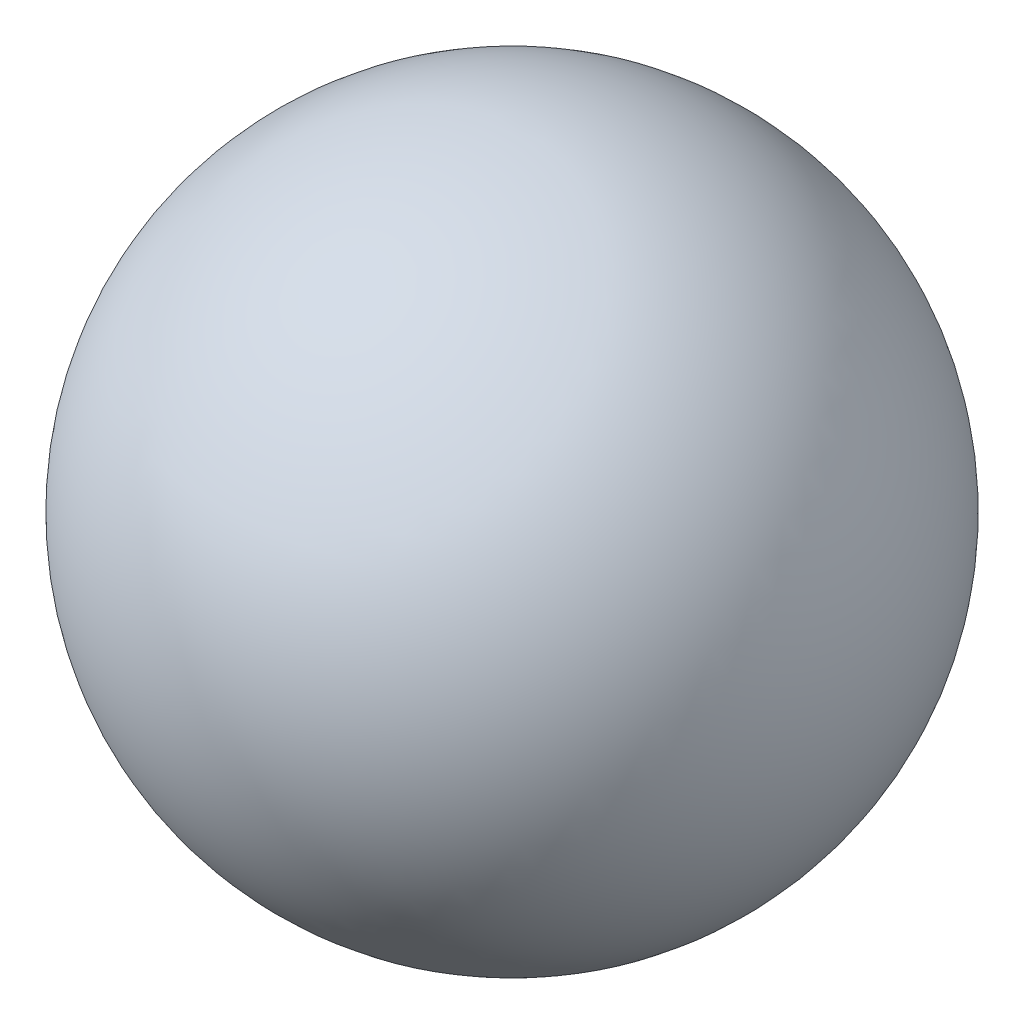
ISO-10303-21;
HEADER;
FILE_DESCRIPTION(('STEP AP214'),'2;1');
FILE_NAME('part.step','',(''),(''),'','','');
FILE_SCHEMA(('AUTOMOTIVE_DESIGN { 1 0 10303 214 1 1 1 1 }'));
ENDSEC;
DATA;
#1=APPLICATION_CONTEXT('core data for automotive mechanical design processes');
#2=APPLICATION_PROTOCOL_DEFINITION('international standard','automotive_design',2000,#1);
#3=PRODUCT_CONTEXT('',#1,'mechanical');
#4=PRODUCT('Part','Part','',(#3));
#5=PRODUCT_RELATED_PRODUCT_CATEGORY('part','',(#4));
#6=PRODUCT_DEFINITION_FORMATION('','',#4);
#7=PRODUCT_DEFINITION_CONTEXT('part definition',#1,'design');
#8=PRODUCT_DEFINITION('design','',#6,#7);
#9=PRODUCT_DEFINITION_SHAPE('','',#8);
#10=(LENGTH_UNIT() NAMED_UNIT(*) SI_UNIT(.MILLI.,.METRE.));
#11=(NAMED_UNIT(*) PLANE_ANGLE_UNIT() SI_UNIT($,.RADIAN.));
#12=(NAMED_UNIT(*) SI_UNIT($,.STERADIAN.) SOLID_ANGLE_UNIT());
#13=UNCERTAINTY_MEASURE_WITH_UNIT(LENGTH_MEASURE(1.E-05),#10,'distance_accuracy_value','');
#14=(GEOMETRIC_REPRESENTATION_CONTEXT(3) GLOBAL_UNCERTAINTY_ASSIGNED_CONTEXT((#13)) GLOBAL_UNIT_ASSIGNED_CONTEXT((#10,
#11,#12)) REPRESENTATION_CONTEXT('',''));
#15=CARTESIAN_POINT('',(0.,0.,0.));
#16=DIRECTION('',(0.,0.,1.));
#17=DIRECTION('',(1.,0.,0.));
#18=AXIS2_PLACEMENT_3D('',#15,#16,#17);
#19=CARTESIAN_POINT('',(-300.,600.,0.));
#20=DIRECTION('',(0.,1.,0.));
#21=DIRECTION('',(-1.,0.,0.));
#22=AXIS2_PLACEMENT_3D('',#19,#20,#21);
#23=SPHERICAL_SURFACE('',#22,1550.36756758);
#24=CARTESIAN_POINT('',(-300.,-805.110199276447,0.));
#25=DIRECTION('',(0.,1.,0.));
#26=DIRECTION('',(-1.,0.,0.));
#27=AXIS2_PLACEMENT_3D('',#24,#25,#26);
#28=CIRCLE('',#27,655.213646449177);
#29=CARTESIAN_POINT('',(-955.213646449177,-805.110199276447,0.));
#30=VERTEX_POINT('',#29);
#31=EDGE_CURVE('E36',#30,#30,#28,.T.);
#32=ORIENTED_EDGE('',*,*,#31,.T.);
#33=EDGE_LOOP('',(#32));
#34=FACE_BOUND('',#33,.T.);
#35=ADVANCED_FACE('F15',(#34),#23,.T.);
#36=CARTESIAN_POINT('',(-595.832783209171,-34.4154509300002,0.));
#37=DIRECTION('',(0.,0.,-1.));
#38=DIRECTION('',(-1.,0.,0.));
#39=AXIS2_PLACEMENT_3D('',#36,#37,#38);
#40=CIRCLE('',#39,850.36756758);
#41=TRIMMED_CURVE('',#40,(PARAMETER_VALUE(-1.92611391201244)),
(PARAMETER_VALUE(1.92611391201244)),.T.,.PARAMETER.);
#42=CARTESIAN_POINT('',(-300.,-34.4154509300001,0.));
#43=DIRECTION('',(0.,1.,0.));
#44=AXIS1_PLACEMENT('',#42,#43);
#45=SURFACE_OF_REVOLUTION('',#41,#44);
#46=CARTESIAN_POINT('',(-300.,-831.665702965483,0.));
#47=VERTEX_POINT('',#46);
#48=VERTEX_LOOP('',#47);
#49=FACE_BOUND('',#48,.T.);
#50=ORIENTED_EDGE('',*,*,#31,.F.);
#51=EDGE_LOOP('',(#50));
#52=FACE_BOUND('',#51,.T.);
#53=ADVANCED_FACE('F30',(#49,#52),#45,.T.);
#54=CLOSED_SHELL('',(#35,#53));
#55=CARTESIAN_POINT('',(56.50784603,143.782535,0.));
#56=DIRECTION('',(0.,0.,-1.));
#57=DIRECTION('',(-1.,0.,0.));
#58=AXIS2_PLACEMENT_3D('',#55,#56,#57);
#59=CIRCLE('',#58,580.6534894);
#60=TRIMMED_CURVE('',#59,(PARAMETER_VALUE(-0.909707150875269)),
(PARAMETER_VALUE(0.909707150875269)),.T.,.PARAMETER.);
#61=CARTESIAN_POINT('',(-300.,143.782535,0.));
#62=DIRECTION('',(0.,1.,0.));
#63=AXIS1_PLACEMENT('',#61,#62);
#64=SURFACE_OF_REVOLUTION('',#60,#63);
#65=CARTESIAN_POINT('',(-300.,324.930025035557,0.));
#66=DIRECTION('',(0.,1.,0.));
#67=DIRECTION('',(-1.,0.,0.));
#68=AXIS2_PLACEMENT_3D('',#65,#66,#67);
#69=CIRCLE('',#68,195.166026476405);
#70=CARTESIAN_POINT('',(-104.833973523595,324.930025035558,-1.3628378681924E-12));
#71=VERTEX_POINT('',#70);
#72=EDGE_CURVE('E9',#71,#71,#69,.T.);
#73=ORIENTED_EDGE('',*,*,#72,.T.);
#74=EDGE_LOOP('',(#73));
#75=FACE_BOUND('',#74,.T.);
#76=CARTESIAN_POINT('',(-300.,-314.541182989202,0.));
#77=VERTEX_POINT('',#76);
#78=VERTEX_LOOP('',#77);
#79=FACE_BOUND('',#78,.T.);
#80=ADVANCED_FACE('F17',(#75,#79),#64,.F.);
#81=CARTESIAN_POINT('',(-300.,600.,0.));
#82=DIRECTION('',(0.,1.,0.));
#83=DIRECTION('',(1.,0.,0.));
#84=AXIS2_PLACEMENT_3D('',#81,#82,#83);
#85=SPHERICAL_SURFACE('',#84,337.27328536);
#86=CARTESIAN_POINT('',(-300.,839.966415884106,0.));
#87=DIRECTION('',(0.,1.,0.));
#88=DIRECTION('',(-1.,0.,0.));
#89=AXIS2_PLACEMENT_3D('',#86,#87,#88);
#90=CIRCLE('',#89,237.000819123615);
#91=CARTESIAN_POINT('',(-62.9991808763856,839.966415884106,-1.65496883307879E-12));
#92=VERTEX_POINT('',#91);
#93=EDGE_CURVE('E24',#92,#92,#90,.T.);
#94=CARTESIAN_POINT('',(-62.9991808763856,839.966415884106,-1.65496883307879E-12));
#95=CARTESIAN_POINT('',(-60.8178165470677,837.812025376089,-1.67020122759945E-12));
#96=CARTESIAN_POINT('',(-58.6658440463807,835.627876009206,-1.68522837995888E-12));
#97=CARTESIAN_POINT('',(-54.4222476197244,831.20171773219,-1.71486127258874E-12));
#98=CARTESIAN_POINT('',(-52.3306236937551,828.959708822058,-1.72946701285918E-12));
#99=CARTESIAN_POINT('',(-48.2092893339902,824.419489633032,-1.75824615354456E-12));
#100=CARTESIAN_POINT('',(-46.1795789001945,822.121279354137,-1.77241955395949E-12));
#101=CARTESIAN_POINT('',(-42.1835783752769,817.470368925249,-1.80032349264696E-12));
#102=CARTESIAN_POINT('',(-40.217288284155,815.117668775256,-1.8140540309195E-12));
#103=CARTESIAN_POINT('',(-36.3495913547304,810.359527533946,-1.8410620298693E-12));
#104=CARTESIAN_POINT('',(-34.4481845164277,807.95408644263,-1.85433949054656E-12));
#105=CARTESIAN_POINT('',(-30.7116678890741,803.092252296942,-1.88043146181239E-12));
#106=CARTESIAN_POINT('',(-28.8765581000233,800.63585924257,-1.89324597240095E-12));
#107=CARTESIAN_POINT('',(-25.2740002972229,795.673947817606,-1.91840251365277E-12));
#108=CARTESIAN_POINT('',(-23.5065522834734,793.168429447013,-1.93074454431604E-12));
#109=CARTESIAN_POINT('',(-20.0406323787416,788.110130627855,-1.95494694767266E-12));
#110=CARTESIAN_POINT('',(-18.3421604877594,785.557350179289,-1.96680732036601E-12));
#111=CARTESIAN_POINT('',(-15.0154558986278,780.406425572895,-1.99003758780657E-12));
#112=CARTESIAN_POINT('',(-13.3872232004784,777.808281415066,-2.00140748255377E-12));
#113=CARTESIAN_POINT('',(-10.2022078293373,772.56856149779,-2.02364833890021E-12));
#114=CARTESIAN_POINT('',(-8.64542515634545,769.926985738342,-2.03451930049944E-12));
#115=CARTESIAN_POINT('',(-5.60446753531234,764.602367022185,-2.05575420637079E-12));
#116=CARTESIAN_POINT('',(-4.12029258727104,761.919324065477,-2.06611815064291E-12));
#117=CARTESIAN_POINT('',(-1.2256541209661,756.513766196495,-2.08633131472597E-12));
#118=CARTESIAN_POINT('',(0.184809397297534,753.791251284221,-2.09618053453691E-12));
#119=CARTESIAN_POINT('',(2.93097611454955,748.308774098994,-2.11535692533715E-12));
#120=CARTESIAN_POINT('',(4.26667931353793,745.548811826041,-2.12468409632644E-12));
#121=CARTESIAN_POINT('',(6.86233209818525,739.993492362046,-2.14280945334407E-12));
#122=CARTESIAN_POINT('',(8.12228168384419,737.198135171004,-2.1516076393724E-12));
#123=CARTESIAN_POINT('',(10.5654902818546,731.574104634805,-2.16866848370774E-12));
#124=CARTESIAN_POINT('',(11.7487492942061,728.745431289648,-2.17693114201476E-12));
#125=CARTESIAN_POINT('',(14.037696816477,723.056871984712,-2.19291478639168E-12));
#126=CARTESIAN_POINT('',(15.1433853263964,720.196986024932,-2.20063577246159E-12));
#127=CARTESIAN_POINT('',(17.2763695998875,714.448128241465,-2.21553033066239E-12));
#128=CARTESIAN_POINT('',(18.3036653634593,711.559156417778,-2.22270390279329E-12));
#129=CARTESIAN_POINT('',(20.2791001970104,705.754275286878,-2.23649829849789E-12));
#130=CARTESIAN_POINT('',(21.2272392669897,702.838365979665,-2.24311912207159E-12));
#131=CARTESIAN_POINT('',(23.0436556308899,696.981778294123,-2.2558030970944E-12));
#132=CARTESIAN_POINT('',(23.9119329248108,694.041099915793,-2.26186624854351E-12));
#133=CARTESIAN_POINT('',(25.5679800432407,688.137160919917,-2.27343037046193E-12));
#134=CARTESIAN_POINT('',(26.3557498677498,685.17390030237,-2.27893134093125E-12));
#135=CARTESIAN_POINT('',(27.8501962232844,679.227000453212,-2.28936701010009E-12));
#136=CARTESIAN_POINT('',(28.55687275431,676.243361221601,-2.29430170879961E-12));
#137=CARTESIAN_POINT('',(29.8886070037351,670.257922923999,-2.30360116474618E-12));
#138=CARTESIAN_POINT('',(30.5136647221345,667.256123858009,-2.30796592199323E-12));
#139=CARTESIAN_POINT('',(31.6816965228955,661.236598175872,-2.31612224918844E-12));
#140=CARTESIAN_POINT('',(32.2246706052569,658.218871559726,-2.3199138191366E-12));
#141=CARTESIAN_POINT('',(33.2281313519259,652.169734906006,-2.32692095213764E-12));
#142=CARTESIAN_POINT('',(33.6886180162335,649.138324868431,-2.33013651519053E-12));
#143=CARTESIAN_POINT('',(34.5267614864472,643.064075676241,-2.33598924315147E-12));
#144=CARTESIAN_POINT('',(34.9044182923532,640.021236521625,-2.33862640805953E-12));
#145=CARTESIAN_POINT('',(35.5766212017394,633.926391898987,-2.34332037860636E-12));
#146=CARTESIAN_POINT('',(35.8711673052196,630.874386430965,-2.34537718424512E-12));
#147=CARTESIAN_POINT('',(36.3769297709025,624.763478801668,-2.34890890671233E-12));
#148=CARTESIAN_POINT('',(36.5881461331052,621.704576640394,-2.35038382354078E-12));
#149=CARTESIAN_POINT('',(36.9270920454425,615.582150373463,-2.35275067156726E-12));
#150=CARTESIAN_POINT('',(37.0548215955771,612.518626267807,-2.3536426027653E-12));
#151=CARTESIAN_POINT('',(37.2266988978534,606.389234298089,-2.3548428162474E-12));
#152=CARTESIAN_POINT('',(37.2708466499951,603.323366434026,-2.35515109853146E-12));
#153=CARTESIAN_POINT('',(37.2755275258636,597.191566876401,-2.35518378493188E-12));
#154=CARTESIAN_POINT('',(37.2360606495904,594.125635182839,-2.35490818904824E-12));
#155=CARTESIAN_POINT('',(37.0735416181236,587.995987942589,-2.35377332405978E-12));
#156=CARTESIAN_POINT('',(36.9504894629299,584.932272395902,-2.35291405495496E-12));
#157=CARTESIAN_POINT('',(36.6208913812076,578.809335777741,-2.35061248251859E-12));
#158=CARTESIAN_POINT('',(36.4143454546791,575.750114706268,-2.34917017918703E-12));
#159=CARTESIAN_POINT('',(35.9179134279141,569.638442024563,-2.34570361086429E-12));
#160=CARTESIAN_POINT('',(35.6280273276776,566.585990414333,-2.3436793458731E-12));
#161=CARTESIAN_POINT('',(34.9651305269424,560.49012660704,-2.3390503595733E-12));
#162=CARTESIAN_POINT('',(34.5921198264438,557.446714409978,-2.33644563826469E-12));
#163=CARTESIAN_POINT('',(33.7632512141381,551.371192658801,-2.33065767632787E-12));
#164=CARTESIAN_POINT('',(33.307393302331,548.339083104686,-2.32747443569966E-12));
#165=CARTESIAN_POINT('',(32.31316926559,542.288421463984,-2.32053180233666E-12));
#166=CARTESIAN_POINT('',(31.774803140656,539.269869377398,-2.31677240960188E-12));
#167=CARTESIAN_POINT('',(30.615963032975,533.248567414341,-2.30868026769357E-12));
#168=CARTESIAN_POINT('',(29.995489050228,530.24581753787,-2.30434751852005E-12));
#169=CARTESIAN_POINT('',(28.6728946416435,524.258352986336,-2.29511188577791E-12));
#170=CARTESIAN_POINT('',(27.970774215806,521.273638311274,-2.2902090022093E-12));
#171=CARTESIAN_POINT('',(26.4854090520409,515.324463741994,-2.27983674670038E-12));
#172=CARTESIAN_POINT('',(25.7021643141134,512.360003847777,-2.27436737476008E-12));
#173=CARTESIAN_POINT('',(24.0551329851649,506.453543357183,-2.26286620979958E-12));
#174=CARTESIAN_POINT('',(23.1913463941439,503.511542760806,-2.25683441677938E-12));
#175=CARTESIAN_POINT('',(21.3838737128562,497.652188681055,-2.24421289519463E-12));
#176=CARTESIAN_POINT('',(20.4401876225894,494.734835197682,-2.23762316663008E-12));
#177=CARTESIAN_POINT('',(18.473617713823,488.926944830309,-2.22389067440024E-12));
#178=CARTESIAN_POINT('',(17.4507338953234,486.03640794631,-2.21674791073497E-12));
#179=CARTESIAN_POINT('',(15.3265291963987,480.284300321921,-2.20191466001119E-12));
#180=CARTESIAN_POINT('',(14.2252083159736,477.422729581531,-2.1942241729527E-12));
#181=CARTESIAN_POINT('',(11.9449484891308,471.730682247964,-2.17830119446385E-12));
#182=CARTESIAN_POINT('',(10.7660095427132,468.900205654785,-2.17006870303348E-12));
#183=CARTESIAN_POINT('',(8.33139030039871,463.272451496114,-2.15306783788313E-12));
#184=CARTESIAN_POINT('',(7.0757100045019,460.475173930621,-2.14429946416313E-12));
#185=CARTESIAN_POINT('',(4.48854184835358,454.915898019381,-2.12623335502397E-12));
#186=CARTESIAN_POINT('',(3.15705398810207,452.153899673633,-2.11693561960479E-12));
#187=CARTESIAN_POINT('',(0.41926086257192,446.667236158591,-2.0978177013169E-12));
#188=CARTESIAN_POINT('',(-0.987044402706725,443.942570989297,-2.08799751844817E-12));
#189=CARTESIAN_POINT('',(-3.87342654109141,438.532600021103,-2.06784200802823E-12));
#190=CARTESIAN_POINT('',(-5.35350341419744,435.847294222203,-2.057506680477E-12));
#191=CARTESIAN_POINT('',(-8.38632811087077,430.518038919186,-2.03632856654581E-12));
#192=CARTESIAN_POINT('',(-9.93907593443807,427.874089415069,-2.02548578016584E-12));
#193=CARTESIAN_POINT('',(-13.1160878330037,422.629512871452,-2.00330081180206E-12));
#194=CARTESIAN_POINT('',(-14.740351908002,420.028885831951,-1.99195862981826E-12));
#195=CARTESIAN_POINT('',(-18.0591884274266,414.8728881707,-1.96878330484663E-12));
#196=CARTESIAN_POINT('',(-19.7537608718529,412.317517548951,-1.95695016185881E-12));
#197=CARTESIAN_POINT('',(-23.2119539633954,407.253933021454,-1.93280171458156E-12));
#198=CARTESIAN_POINT('',(-24.9755746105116,404.745719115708,-1.92048641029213E-12));
#199=CARTESIAN_POINT('',(-28.5705525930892,399.778313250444,-1.89538279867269E-12));
#200=CARTESIAN_POINT('',(-30.4019099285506,397.319121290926,-1.88259449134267E-12));
#201=CARTESIAN_POINT('',(-34.1309994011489,392.451588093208,-1.85655438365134E-12));
#202=CARTESIAN_POINT('',(-36.0287315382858,390.043246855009,-1.84330258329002E-12));
#203=CARTESIAN_POINT('',(-39.889159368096,385.279206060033,-1.81634534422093E-12));
#204=CARTESIAN_POINT('',(-41.8518550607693,382.923506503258,-1.80263990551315E-12));
#205=CARTESIAN_POINT('',(-45.8407504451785,378.266500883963,-1.77478558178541E-12));
#206=CARTESIAN_POINT('',(-47.8669501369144,375.965194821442,-1.76063669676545E-12));
#207=CARTESIAN_POINT('',(-51.9813467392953,371.418687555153,-1.73190600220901E-12));
#208=CARTESIAN_POINT('',(-54.0695436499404,369.173486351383,-1.71732419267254E-12));
#209=CARTESIAN_POINT('',(-58.3063818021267,364.740858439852,-1.6877384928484E-12));
#210=CARTESIAN_POINT('',(-60.4550230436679,362.553431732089,-1.67273460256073E-12));
#211=CARTESIAN_POINT('',(-64.8111520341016,358.23797950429,-1.64231589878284E-12));
#212=CARTESIAN_POINT('',(-67.0186397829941,356.109953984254,-1.62690108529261E-12));
#213=CARTESIAN_POINT('',(-71.4908201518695,351.914886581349,-1.595671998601E-12));
#214=CARTESIAN_POINT('',(-73.7555127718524,349.847844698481,-1.5798577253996E-12));
#215=CARTESIAN_POINT('',(-78.3404188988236,345.776281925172,-1.54784147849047E-12));
#216=CARTESIAN_POINT('',(-80.6606324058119,343.771761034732,-1.53163950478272E-12));
#217=CARTESIAN_POINT('',(-85.3548543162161,339.826730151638,-1.49885990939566E-12));
#218=CARTESIAN_POINT('',(-87.7288627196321,337.886220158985,-1.48228228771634E-12));
#219=CARTESIAN_POINT('',(-92.5289111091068,334.07065694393,-1.4487637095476E-12));
#220=CARTESIAN_POINT('',(-94.9549510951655,332.195603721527,-1.43182275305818E-12));
#221=CARTESIAN_POINT('',(-99.8572506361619,328.512337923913,-1.39759015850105E-12));
#222=CARTESIAN_POINT('',(-102.333510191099,326.704125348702,-1.38029852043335E-12));
#223=CARTESIAN_POINT('',(-104.833973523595,324.930025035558,-1.3628378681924E-12));
#224=B_SPLINE_CURVE_WITH_KNOTS('',3,(#94,#95,#96,#97,#98,#99,#100,#101,#102,#103,#104,#105,#106,
#107,#108,#109,#110,#111,#112,#113,#114,#115,#116,#117,#118,#119,#120,#121,#122,#123,#124,#125,
#126,#127,#128,#129,#130,#131,#132,#133,#134,#135,#136,#137,#138,#139,#140,#141,#142,#143,#144,
#145,#146,#147,#148,#149,#150,#151,#152,#153,#154,#155,#156,#157,#158,#159,#160,#161,#162,#163,
#164,#165,#166,#167,#168,#169,#170,#171,#172,#173,#174,#175,#176,#177,#178,#179,#180,#181,#182,
#183,#184,#185,#186,#187,#188,#189,#190,#191,#192,#193,#194,#195,#196,#197,#198,#199,#200,#201,
#202,#203,#204,#205,#206,#207,#208,#209,#210,#211,#212,#213,#214,#215,#216,#217,#218,#219,#220,
#221,#222,#223),.UNSPECIFIED.,.F.,.F.,(4,2,2,2,2,2,2,2,2,2,2,2,2,2,2,2,2,2,2,2,2,2,2,2,2,2,2,2,
2,2,2,2,2,2,2,2,2,2,2,2,2,2,2,2,2,2,2,2,2,2,2,2,2,2,2,2,2,2,2,2,2,2,2,2,4),(0.,9.19741703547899,
18.394834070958,27.5922511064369,36.7896681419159,45.9870851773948,55.1845022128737,
64.3819192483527,73.5793362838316,82.7767533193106,91.9741703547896,101.171587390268,
110.369004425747,119.566421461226,128.763838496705,137.961255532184,147.158672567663,
156.356089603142,165.553506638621,174.7509236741,183.948340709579,193.145757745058,
202.343174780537,211.540591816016,220.738008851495,229.935425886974,239.132842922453,
248.330259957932,257.527676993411,266.725094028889,275.922511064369,285.119928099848,
294.317345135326,303.514762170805,312.712179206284,321.909596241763,331.107013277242,
340.304430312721,349.5018473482,358.699264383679,367.896681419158,377.094098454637,
386.291515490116,395.488932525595,404.686349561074,413.883766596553,423.081183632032,
432.278600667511,441.47601770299,450.673434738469,459.870851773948,469.068268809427,
478.265685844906,487.463102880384,496.660519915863,505.857936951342,515.055353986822,
524.2527710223,533.450188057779,542.647605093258,551.845022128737,561.042439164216,
570.239856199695,579.437273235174,588.634690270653),.UNSPECIFIED.);
#225=EDGE_CURVE('BSEAM45',#92,#71,#224,.T.);
#226=ORIENTED_EDGE('',*,*,#93,.T.);
#227=ORIENTED_EDGE('',*,*,#72,.F.);
#228=ORIENTED_EDGE('',*,*,#225,.T.);
#229=ORIENTED_EDGE('',*,*,#225,.F.);
#230=EDGE_LOOP('',(#226,#228,#227,#229));
#231=FACE_BOUND('',#230,.T.);
#232=ADVANCED_FACE('F45',(#231),#85,.F.);
#233=CARTESIAN_POINT('',(-300.,950.,0.));
#234=DIRECTION('',(0.,1.,0.));
#235=DIRECTION('',(-1.,0.,0.));
#236=AXIS2_PLACEMENT_3D('',#233,#234,#235);
#237=DEGENERATE_TOROIDAL_SURFACE('',#236,606.217782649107,850.36756759,.F.);
#238=CARTESIAN_POINT('',(-300.,1341.79549406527,0.));
#239=DIRECTION('',(0.,1.,0.));
#240=DIRECTION('',(-1.,0.,0.));
#241=AXIS2_PLACEMENT_3D('',#238,#239,#240);
#242=CIRCLE('',#241,148.5148129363);
#243=CARTESIAN_POINT('',(-448.5148129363,1341.79549406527,0.));
#244=VERTEX_POINT('',#243);
#245=EDGE_CURVE('E38',#244,#244,#242,.T.);
#246=ORIENTED_EDGE('',*,*,#245,.T.);
#247=EDGE_LOOP('',(#246));
#248=FACE_BOUND('',#247,.T.);
#249=ORIENTED_EDGE('',*,*,#93,.F.);
#250=EDGE_LOOP('',(#249));
#251=FACE_BOUND('',#250,.T.);
#252=ADVANCED_FACE('F48',(#248,#251),#237,.T.);
#253=CARTESIAN_POINT('',(-300.,600.,0.));
#254=DIRECTION('',(0.,1.,0.));
#255=DIRECTION('',(1.,0.,0.));
#256=AXIS2_PLACEMENT_3D('',#253,#254,#255);
#257=SPHERICAL_SURFACE('',#256,756.516493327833);
#258=ORIENTED_EDGE('',*,*,#245,.F.);
#259=EDGE_LOOP('',(#258));
#260=FACE_BOUND('',#259,.T.);
#261=ADVANCED_FACE('F50',(#260),#257,.F.);
#262=CLOSED_SHELL('',(#80,#232,#252,#261));
#263=ORIENTED_CLOSED_SHELL('',*,#262,.T.);
#264=BREP_WITH_VOIDS('B1',#54,(#263));
#265=ADVANCED_BREP_SHAPE_REPRESENTATION('',(#18,#264),#14);
#266=SHAPE_DEFINITION_REPRESENTATION(#9,#265);
ENDSEC;
END-ISO-10303-21;
